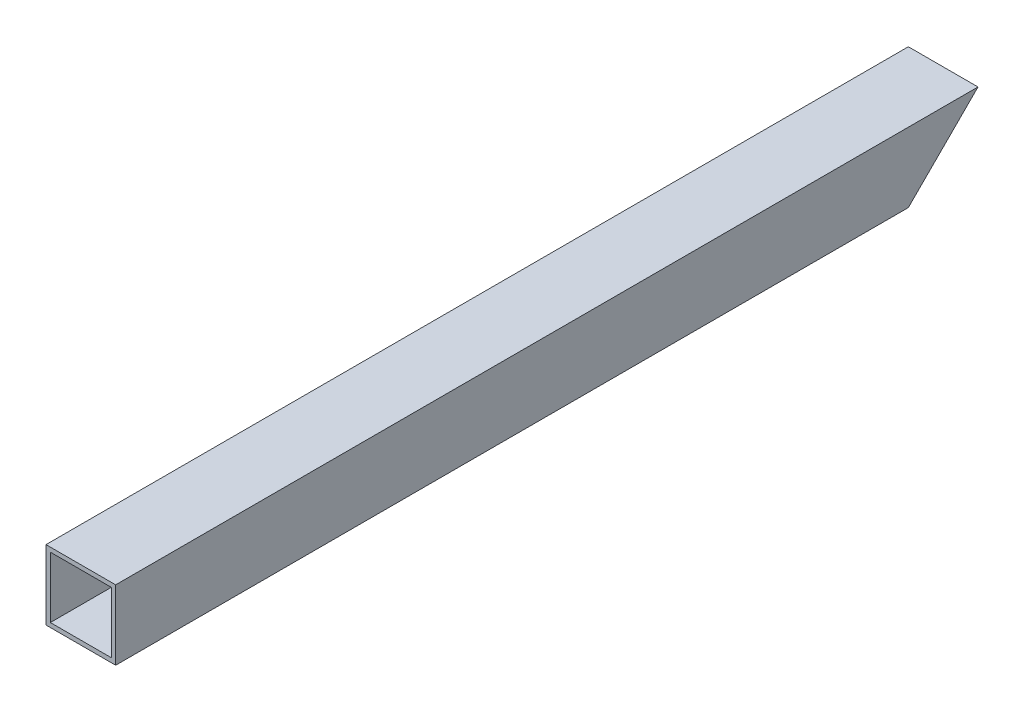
ISO-10303-21;
HEADER;
FILE_DESCRIPTION(('STEP AP214'),'2;1');
FILE_NAME('part.step','',(''),(''),'','','');
FILE_SCHEMA(('AUTOMOTIVE_DESIGN { 1 0 10303 214 1 1 1 1 }'));
ENDSEC;
DATA;
#1=APPLICATION_CONTEXT('core data for automotive mechanical design processes');
#2=APPLICATION_PROTOCOL_DEFINITION('international standard','automotive_design',2000,#1);
#3=PRODUCT_CONTEXT('',#1,'mechanical');
#4=PRODUCT('Part','Part','',(#3));
#5=PRODUCT_RELATED_PRODUCT_CATEGORY('part','',(#4));
#6=PRODUCT_DEFINITION_FORMATION('','',#4);
#7=PRODUCT_DEFINITION_CONTEXT('part definition',#1,'design');
#8=PRODUCT_DEFINITION('design','',#6,#7);
#9=PRODUCT_DEFINITION_SHAPE('','',#8);
#10=(LENGTH_UNIT() NAMED_UNIT(*) SI_UNIT(.MILLI.,.METRE.));
#11=(NAMED_UNIT(*) PLANE_ANGLE_UNIT() SI_UNIT($,.RADIAN.));
#12=(NAMED_UNIT(*) SI_UNIT($,.STERADIAN.) SOLID_ANGLE_UNIT());
#13=UNCERTAINTY_MEASURE_WITH_UNIT(LENGTH_MEASURE(1.E-05),#10,'distance_accuracy_value','');
#14=(GEOMETRIC_REPRESENTATION_CONTEXT(3) GLOBAL_UNCERTAINTY_ASSIGNED_CONTEXT((#13)) GLOBAL_UNIT_ASSIGNED_CONTEXT((#10,
#11,#12)) REPRESENTATION_CONTEXT('',''));
#15=CARTESIAN_POINT('',(0.,0.,0.));
#16=DIRECTION('',(0.,0.,1.));
#17=DIRECTION('',(1.,0.,0.));
#18=AXIS2_PLACEMENT_3D('',#15,#16,#17);
#19=CARTESIAN_POINT('',(-25.3999999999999,-25.399999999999,-628.8024));
#20=DIRECTION('',(-1.00000000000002,0.,0.));
#21=DIRECTION('',(0.,0.,1.));
#22=AXIS2_PLACEMENT_3D('',#19,#20,#21);
#23=PLANE('',#22);
#24=DIRECTION('',(0.,0.707106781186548,-0.707106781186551));
#25=VECTOR('',#24,1.);
#26=CARTESIAN_POINT('',(-25.4000000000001,1.11022302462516E-12,-603.4024));
#27=LINE('',#26,#25);
#28=CARTESIAN_POINT('',(-25.3999999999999,-25.4,-578.0024));
#29=VERTEX_POINT('',#28);
#30=CARTESIAN_POINT('',(-25.3999999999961,25.4,-628.8024));
#31=VERTEX_POINT('',#30);
#32=EDGE_CURVE('E100',#29,#31,#27,.T.);
#33=ORIENTED_EDGE('',*,*,#32,.F.);
#34=DIRECTION('',(0.,0.,1.));
#35=VECTOR('',#34,1.);
#36=CARTESIAN_POINT('',(-25.3999999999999,-25.399999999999,-628.8024));
#37=LINE('',#36,#35);
#38=CARTESIAN_POINT('',(-25.3999999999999,-25.400000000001,0.));
#39=VERTEX_POINT('',#38);
#40=EDGE_CURVE('E111',#29,#39,#37,.T.);
#41=ORIENTED_EDGE('',*,*,#40,.T.);
#42=DIRECTION('',(0.,-1.,0.));
#43=VECTOR('',#42,1.);
#44=CARTESIAN_POINT('',(-25.3999999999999,-25.400000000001,0.));
#45=LINE('',#44,#43);
#46=CARTESIAN_POINT('',(-25.3999999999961,25.4,0.));
#47=VERTEX_POINT('',#46);
#48=EDGE_CURVE('E135',#47,#39,#45,.T.);
#49=ORIENTED_EDGE('',*,*,#48,.F.);
#50=DIRECTION('',(0.,0.,1.));
#51=VECTOR('',#50,1.);
#52=CARTESIAN_POINT('',(-25.3999999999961,25.4,-628.8024));
#53=LINE('',#52,#51);
#54=EDGE_CURVE('E41',#31,#47,#53,.T.);
#55=ORIENTED_EDGE('',*,*,#54,.F.);
#56=EDGE_LOOP('',(#33,#41,#49,#55));
#57=FACE_BOUND('',#56,.T.);
#58=ADVANCED_FACE('F34',(#57),#23,.T.);
#59=CARTESIAN_POINT('',(-25.3999999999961,25.4,-628.8024));
#60=DIRECTION('',(0.,1.,0.));
#61=DIRECTION('',(0.,0.,1.));
#62=AXIS2_PLACEMENT_3D('',#59,#60,#61);
#63=PLANE('',#62);
#64=DIRECTION('',(-1.00000000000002,0.,0.));
#65=VECTOR('',#64,1.);
#66=CARTESIAN_POINT('',(-25.3999999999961,25.4,0.));
#67=LINE('',#66,#65);
#68=CARTESIAN_POINT('',(25.4000000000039,25.4,0.));
#69=VERTEX_POINT('',#68);
#70=EDGE_CURVE('E124',#69,#47,#67,.T.);
#71=ORIENTED_EDGE('',*,*,#70,.F.);
#72=DIRECTION('',(0.,0.,1.));
#73=VECTOR('',#72,1.);
#74=CARTESIAN_POINT('',(25.4000000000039,25.4,-628.8024));
#75=LINE('',#74,#73);
#76=CARTESIAN_POINT('',(25.4000000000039,25.4,-628.8024));
#77=VERTEX_POINT('',#76);
#78=EDGE_CURVE('E122',#77,#69,#75,.T.);
#79=ORIENTED_EDGE('',*,*,#78,.F.);
#80=DIRECTION('',(-1.00000000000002,0.,0.));
#81=VECTOR('',#80,1.);
#82=CARTESIAN_POINT('',(-25.3999999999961,25.4,-628.8024));
#83=LINE('',#82,#81);
#84=EDGE_CURVE('E121',#77,#31,#83,.T.);
#85=ORIENTED_EDGE('',*,*,#84,.T.);
#86=ORIENTED_EDGE('',*,*,#54,.T.);
#87=EDGE_LOOP('',(#71,#79,#85,#86));
#88=FACE_BOUND('',#87,.T.);
#89=ADVANCED_FACE('F186',(#88),#63,.T.);
#90=CARTESIAN_POINT('',(25.4000000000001,-25.4,-628.8024));
#91=DIRECTION('',(1.00000000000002,0.,0.));
#92=DIRECTION('',(0.,1.,0.));
#93=AXIS2_PLACEMENT_3D('',#90,#91,#92);
#94=PLANE('',#93);
#95=DIRECTION('',(0.,-0.707106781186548,0.707106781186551));
#96=VECTOR('',#95,1.);
#97=CARTESIAN_POINT('',(25.4000000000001,1.0547118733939E-12,-603.4024));
#98=LINE('',#97,#96);
#99=CARTESIAN_POINT('',(25.4000000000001,-25.4,-578.0024));
#100=VERTEX_POINT('',#99);
#101=EDGE_CURVE('E103',#77,#100,#98,.T.);
#102=ORIENTED_EDGE('',*,*,#101,.F.);
#103=ORIENTED_EDGE('',*,*,#78,.T.);
#104=DIRECTION('',(0.,1.,0.));
#105=VECTOR('',#104,1.);
#106=CARTESIAN_POINT('',(25.4000000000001,-25.4,0.));
#107=LINE('',#106,#105);
#108=CARTESIAN_POINT('',(25.4000000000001,-25.4,0.));
#109=VERTEX_POINT('',#108);
#110=EDGE_CURVE('E131',#109,#69,#107,.T.);
#111=ORIENTED_EDGE('',*,*,#110,.F.);
#112=DIRECTION('',(0.,0.,1.));
#113=VECTOR('',#112,1.);
#114=CARTESIAN_POINT('',(25.4000000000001,-25.4,-628.8024));
#115=LINE('',#114,#113);
#116=EDGE_CURVE('E120',#100,#109,#115,.T.);
#117=ORIENTED_EDGE('',*,*,#116,.F.);
#118=EDGE_LOOP('',(#102,#103,#111,#117));
#119=FACE_BOUND('',#118,.T.);
#120=ADVANCED_FACE('F190',(#119),#94,.T.);
#121=CARTESIAN_POINT('',(-25.3999999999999,-25.399999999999,-628.8024));
#122=DIRECTION('',(0.,-1.,0.));
#123=DIRECTION('',(0.,0.,-1.));
#124=AXIS2_PLACEMENT_3D('',#121,#122,#123);
#125=PLANE('',#124);
#126=DIRECTION('',(1.00000000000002,0.,0.));
#127=VECTOR('',#126,1.);
#128=CARTESIAN_POINT('',(-816.516436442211,-25.4,-578.002400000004));
#129=LINE('',#128,#127);
#130=EDGE_CURVE('E97',#29,#100,#129,.T.);
#131=ORIENTED_EDGE('',*,*,#130,.T.);
#132=ORIENTED_EDGE('',*,*,#116,.T.);
#133=DIRECTION('',(1.00000000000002,0.,0.));
#134=VECTOR('',#133,1.);
#135=CARTESIAN_POINT('',(-25.3999999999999,-25.400000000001,0.));
#136=LINE('',#135,#134);
#137=EDGE_CURVE('E118',#39,#109,#136,.T.);
#138=ORIENTED_EDGE('',*,*,#137,.F.);
#139=ORIENTED_EDGE('',*,*,#40,.F.);
#140=EDGE_LOOP('',(#131,#132,#138,#139));
#141=FACE_BOUND('',#140,.T.);
#142=ADVANCED_FACE('F116',(#141),#125,.T.);
#143=CARTESIAN_POINT('',(0.,0.,0.));
#144=DIRECTION('',(0.,0.,-1.));
#145=DIRECTION('',(-1.00000000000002,0.,0.));
#146=AXIS2_PLACEMENT_3D('',#143,#144,#145);
#147=PLANE('',#146);
#148=DIRECTION('',(0.,1.,0.));
#149=VECTOR('',#148,1.);
#150=CARTESIAN_POINT('',(22.2249999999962,-22.225,-3.99680288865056E-12));
#151=LINE('',#150,#149);
#152=CARTESIAN_POINT('',(22.2249999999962,-22.225,-3.99680288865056E-12));
#153=VERTEX_POINT('',#152);
#154=CARTESIAN_POINT('',(22.2250000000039,22.225000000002,0.));
#155=VERTEX_POINT('',#154);
#156=EDGE_CURVE('E150',#153,#155,#151,.T.);
#157=ORIENTED_EDGE('',*,*,#156,.F.);
#158=DIRECTION('',(1.00000000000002,0.,0.));
#159=VECTOR('',#158,1.);
#160=CARTESIAN_POINT('',(-22.2250000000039,-22.225000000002,-3.99680288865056E-12));
#161=LINE('',#160,#159);
#162=CARTESIAN_POINT('',(-22.2250000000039,-22.225000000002,-3.99680288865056E-12));
#163=VERTEX_POINT('',#162);
#164=EDGE_CURVE('E114',#163,#153,#161,.T.);
#165=ORIENTED_EDGE('',*,*,#164,.F.);
#166=DIRECTION('',(0.,-1.,0.));
#167=VECTOR('',#166,1.);
#168=CARTESIAN_POINT('',(-22.2250000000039,-22.225000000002,-3.99680288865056E-12));
#169=LINE('',#168,#167);
#170=CARTESIAN_POINT('',(-22.2249999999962,22.2249999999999,0.));
#171=VERTEX_POINT('',#170);
#172=EDGE_CURVE('E140',#171,#163,#169,.T.);
#173=ORIENTED_EDGE('',*,*,#172,.F.);
#174=DIRECTION('',(-1.00000000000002,0.,0.));
#175=VECTOR('',#174,1.);
#176=CARTESIAN_POINT('',(-22.2249999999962,22.2249999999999,0.));
#177=LINE('',#176,#175);
#178=EDGE_CURVE('E147',#155,#171,#177,.T.);
#179=ORIENTED_EDGE('',*,*,#178,.F.);
#180=EDGE_LOOP('',(#157,#165,#173,#179));
#181=FACE_BOUND('',#180,.T.);
#182=ORIENTED_EDGE('',*,*,#48,.T.);
#183=ORIENTED_EDGE('',*,*,#137,.T.);
#184=ORIENTED_EDGE('',*,*,#110,.T.);
#185=ORIENTED_EDGE('',*,*,#70,.T.);
#186=EDGE_LOOP('',(#182,#183,#184,#185));
#187=FACE_BOUND('',#186,.T.);
#188=ADVANCED_FACE('F169',(#181,#187),#147,.F.);
#189=CARTESIAN_POINT('',(-22.2249999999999,-22.225,-628.802400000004));
#190=DIRECTION('',(0.,-1.,0.));
#191=DIRECTION('',(0.,0.,-1.));
#192=AXIS2_PLACEMENT_3D('',#189,#190,#191);
#193=PLANE('',#192);
#194=DIRECTION('',(0.,0.,1.));
#195=VECTOR('',#194,1.);
#196=CARTESIAN_POINT('',(22.2250000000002,-22.225,-628.802400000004));
#197=LINE('',#196,#195);
#198=CARTESIAN_POINT('',(22.2250000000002,-22.225,-581.177400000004));
#199=VERTEX_POINT('',#198);
#200=EDGE_CURVE('E54',#199,#153,#197,.T.);
#201=ORIENTED_EDGE('',*,*,#200,.F.);
#202=DIRECTION('',(-1.00000000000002,0.,0.));
#203=VECTOR('',#202,1.);
#204=CARTESIAN_POINT('',(-22.2249999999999,-22.225,-581.177400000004));
#205=LINE('',#204,#203);
#206=CARTESIAN_POINT('',(-22.2249999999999,-22.225,-581.177400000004));
#207=VERTEX_POINT('',#206);
#208=EDGE_CURVE('E48',#199,#207,#205,.T.);
#209=ORIENTED_EDGE('',*,*,#208,.T.);
#210=DIRECTION('',(0.,0.,1.));
#211=VECTOR('',#210,1.);
#212=CARTESIAN_POINT('',(-22.2249999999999,-22.225,-628.802400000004));
#213=LINE('',#212,#211);
#214=EDGE_CURVE('E136',#207,#163,#213,.T.);
#215=ORIENTED_EDGE('',*,*,#214,.T.);
#216=ORIENTED_EDGE('',*,*,#164,.T.);
#217=EDGE_LOOP('',(#201,#209,#215,#216));
#218=FACE_BOUND('',#217,.T.);
#219=ADVANCED_FACE('F175',(#218),#193,.F.);
#220=CARTESIAN_POINT('',(-22.2249999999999,-22.225,-628.802400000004));
#221=DIRECTION('',(-1.00000000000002,0.,0.));
#222=DIRECTION('',(0.,0.,1.));
#223=AXIS2_PLACEMENT_3D('',#220,#221,#222);
#224=PLANE('',#223);
#225=ORIENTED_EDGE('',*,*,#214,.F.);
#226=DIRECTION('',(0.,0.707106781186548,-0.707106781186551));
#227=VECTOR('',#226,1.);
#228=CARTESIAN_POINT('',(-22.2249999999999,1.58749999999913,-604.9899));
#229=LINE('',#228,#227);
#230=CARTESIAN_POINT('',(-22.2250000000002,22.225,-625.6274));
#231=VERTEX_POINT('',#230);
#232=EDGE_CURVE('E155',#207,#231,#229,.T.);
#233=ORIENTED_EDGE('',*,*,#232,.T.);
#234=DIRECTION('',(0.,0.,1.));
#235=VECTOR('',#234,1.);
#236=CARTESIAN_POINT('',(-22.2250000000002,22.225,-628.8024));
#237=LINE('',#236,#235);
#238=EDGE_CURVE('E142',#231,#171,#237,.T.);
#239=ORIENTED_EDGE('',*,*,#238,.T.);
#240=ORIENTED_EDGE('',*,*,#172,.T.);
#241=EDGE_LOOP('',(#225,#233,#239,#240));
#242=FACE_BOUND('',#241,.T.);
#243=ADVANCED_FACE('F173',(#242),#224,.F.);
#244=CARTESIAN_POINT('',(-22.2250000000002,22.225,-628.8024));
#245=DIRECTION('',(0.,1.,0.));
#246=DIRECTION('',(-1.00000000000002,0.,0.));
#247=AXIS2_PLACEMENT_3D('',#244,#245,#246);
#248=PLANE('',#247);
#249=ORIENTED_EDGE('',*,*,#238,.F.);
#250=DIRECTION('',(1.00000000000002,0.,0.));
#251=VECTOR('',#250,1.);
#252=CARTESIAN_POINT('',(-22.2250000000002,22.225,-625.6274));
#253=LINE('',#252,#251);
#254=CARTESIAN_POINT('',(22.2249999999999,22.225,-625.6274));
#255=VERTEX_POINT('',#254);
#256=EDGE_CURVE('E107',#231,#255,#253,.T.);
#257=ORIENTED_EDGE('',*,*,#256,.T.);
#258=DIRECTION('',(0.,0.,1.));
#259=VECTOR('',#258,1.);
#260=CARTESIAN_POINT('',(22.2249999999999,22.225000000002,-628.8024));
#261=LINE('',#260,#259);
#262=EDGE_CURVE('E139',#255,#155,#261,.T.);
#263=ORIENTED_EDGE('',*,*,#262,.T.);
#264=ORIENTED_EDGE('',*,*,#178,.T.);
#265=EDGE_LOOP('',(#249,#257,#263,#264));
#266=FACE_BOUND('',#265,.T.);
#267=ADVANCED_FACE('F162',(#266),#248,.F.);
#268=CARTESIAN_POINT('',(22.2250000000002,-22.225,-628.802400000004));
#269=DIRECTION('',(1.00000000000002,0.,0.));
#270=DIRECTION('',(0.,0.,-1.));
#271=AXIS2_PLACEMENT_3D('',#268,#269,#270);
#272=PLANE('',#271);
#273=ORIENTED_EDGE('',*,*,#262,.F.);
#274=DIRECTION('',(0.,-0.707106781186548,0.707106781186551));
#275=VECTOR('',#274,1.);
#276=CARTESIAN_POINT('',(22.2249999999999,1.58750000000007,-604.9899));
#277=LINE('',#276,#275);
#278=EDGE_CURVE('E11',#255,#199,#277,.T.);
#279=ORIENTED_EDGE('',*,*,#278,.T.);
#280=ORIENTED_EDGE('',*,*,#200,.T.);
#281=ORIENTED_EDGE('',*,*,#156,.T.);
#282=EDGE_LOOP('',(#273,#279,#280,#281));
#283=FACE_BOUND('',#282,.T.);
#284=ADVANCED_FACE('F163',(#283),#272,.F.);
#285=CARTESIAN_POINT('',(-816.516436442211,25.4,-628.802400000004));
#286=DIRECTION('',(0.,0.707106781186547,0.707106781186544));
#287=DIRECTION('',(0.,-0.707106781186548,0.707106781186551));
#288=AXIS2_PLACEMENT_3D('',#285,#286,#287);
#289=PLANE('',#288);
#290=ORIENTED_EDGE('',*,*,#130,.F.);
#291=ORIENTED_EDGE('',*,*,#32,.T.);
#292=ORIENTED_EDGE('',*,*,#84,.F.);
#293=ORIENTED_EDGE('',*,*,#101,.T.);
#294=EDGE_LOOP('',(#290,#291,#292,#293));
#295=FACE_BOUND('',#294,.T.);
#296=ORIENTED_EDGE('',*,*,#208,.F.);
#297=ORIENTED_EDGE('',*,*,#278,.F.);
#298=ORIENTED_EDGE('',*,*,#256,.F.);
#299=ORIENTED_EDGE('',*,*,#232,.F.);
#300=EDGE_LOOP('',(#296,#297,#298,#299));
#301=FACE_BOUND('',#300,.T.);
#302=ADVANCED_FACE('F99',(#295,#301),#289,.F.);
#303=CLOSED_SHELL('',(#58,#89,#120,#142,#188,#219,#243,#267,#284,#302));
#304=MANIFOLD_SOLID_BREP('B2',#303);
#305=ADVANCED_BREP_SHAPE_REPRESENTATION('',(#18,#304),#14);
#306=SHAPE_DEFINITION_REPRESENTATION(#9,#305);
ENDSEC;
END-ISO-10303-21;
